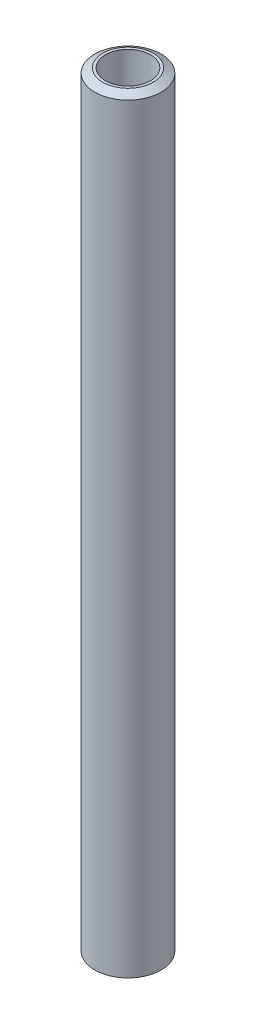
ISO-10303-21;
HEADER;
FILE_DESCRIPTION(('STEP AP214'),'2;1');
FILE_NAME('part.step','',(''),(''),'','','');
FILE_SCHEMA(('AUTOMOTIVE_DESIGN { 1 0 10303 214 1 1 1 1 }'));
ENDSEC;
DATA;
#1=APPLICATION_CONTEXT('core data for automotive mechanical design processes');
#2=APPLICATION_PROTOCOL_DEFINITION('international standard','automotive_design',2000,#1);
#3=PRODUCT_CONTEXT('',#1,'mechanical');
#4=PRODUCT('Part','Part','',(#3));
#5=PRODUCT_RELATED_PRODUCT_CATEGORY('part','',(#4));
#6=PRODUCT_DEFINITION_FORMATION('','',#4);
#7=PRODUCT_DEFINITION_CONTEXT('part definition',#1,'design');
#8=PRODUCT_DEFINITION('design','',#6,#7);
#9=PRODUCT_DEFINITION_SHAPE('','',#8);
#10=(LENGTH_UNIT() NAMED_UNIT(*) SI_UNIT(.MILLI.,.METRE.));
#11=(NAMED_UNIT(*) PLANE_ANGLE_UNIT() SI_UNIT($,.RADIAN.));
#12=(NAMED_UNIT(*) SI_UNIT($,.STERADIAN.) SOLID_ANGLE_UNIT());
#13=UNCERTAINTY_MEASURE_WITH_UNIT(LENGTH_MEASURE(1.E-05),#10,'distance_accuracy_value','');
#14=(GEOMETRIC_REPRESENTATION_CONTEXT(3) GLOBAL_UNCERTAINTY_ASSIGNED_CONTEXT((#13)) GLOBAL_UNIT_ASSIGNED_CONTEXT((#10,
#11,#12)) REPRESENTATION_CONTEXT('',''));
#15=CARTESIAN_POINT('',(0.,0.,0.));
#16=DIRECTION('',(0.,0.,1.));
#17=DIRECTION('',(1.,0.,0.));
#18=AXIS2_PLACEMENT_3D('',#15,#16,#17);
#19=CARTESIAN_POINT('',(0.,290.,0.));
#20=DIRECTION('',(0.,-1.,0.));
#21=DIRECTION('',(0.,0.,-1.));
#22=AXIS2_PLACEMENT_3D('',#19,#20,#21);
#23=CYLINDRICAL_SURFACE('',#22,12.5);
#24=CARTESIAN_POINT('',(0.,288.25,0.));
#25=DIRECTION('',(0.,1.,0.));
#26=DIRECTION('',(0.,0.,1.));
#27=AXIS2_PLACEMENT_3D('',#24,#25,#26);
#28=CIRCLE('',#27,12.5);
#29=CARTESIAN_POINT('',(0.,288.25,12.5));
#30=VERTEX_POINT('',#29);
#31=EDGE_CURVE('E10',#30,#30,#28,.F.);
#32=ORIENTED_EDGE('',*,*,#31,.T.);
#33=EDGE_LOOP('',(#32));
#34=FACE_BOUND('',#33,.T.);
#35=CARTESIAN_POINT('',(0.,1.74999999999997,0.));
#36=DIRECTION('',(0.,1.,0.));
#37=DIRECTION('',(0.,0.,1.));
#38=AXIS2_PLACEMENT_3D('',#35,#36,#37);
#39=CIRCLE('',#38,12.5);
#40=CARTESIAN_POINT('',(0.,1.74999999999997,12.5));
#41=VERTEX_POINT('',#40);
#42=EDGE_CURVE('E46',#41,#41,#39,.T.);
#43=ORIENTED_EDGE('',*,*,#42,.T.);
#44=EDGE_LOOP('',(#43));
#45=FACE_BOUND('',#44,.T.);
#46=ADVANCED_FACE('F31',(#34,#45),#23,.T.);
#47=CARTESIAN_POINT('',(0.,290.,0.));
#48=DIRECTION('',(0.,1.,0.));
#49=DIRECTION('',(0.,0.,1.));
#50=AXIS2_PLACEMENT_3D('',#47,#48,#49);
#51=PLANE('',#50);
#52=CARTESIAN_POINT('',(0.,290.,0.));
#53=DIRECTION('',(0.,1.,0.));
#54=DIRECTION('',(0.,0.,1.));
#55=AXIS2_PLACEMENT_3D('',#52,#53,#54);
#56=CIRCLE('',#55,9.49999999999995);
#57=CARTESIAN_POINT('',(0.,290.,9.49999999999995));
#58=VERTEX_POINT('',#57);
#59=EDGE_CURVE('E38',#58,#58,#56,.T.);
#60=ORIENTED_EDGE('',*,*,#59,.T.);
#61=EDGE_LOOP('',(#60));
#62=FACE_BOUND('',#61,.T.);
#63=CARTESIAN_POINT('',(0.,290.,0.));
#64=DIRECTION('',(0.,1.,0.));
#65=DIRECTION('',(0.,0.,1.));
#66=AXIS2_PLACEMENT_3D('',#63,#64,#65);
#67=CIRCLE('',#66,8.5);
#68=CARTESIAN_POINT('',(0.,290.,8.5));
#69=VERTEX_POINT('',#68);
#70=EDGE_CURVE('E52',#69,#69,#67,.T.);
#71=ORIENTED_EDGE('',*,*,#70,.F.);
#72=EDGE_LOOP('',(#71));
#73=FACE_BOUND('',#72,.T.);
#74=ADVANCED_FACE('F67',(#62,#73),#51,.T.);
#75=CARTESIAN_POINT('',(0.,0.,0.));
#76=DIRECTION('',(0.,1.,0.));
#77=DIRECTION('',(0.,0.,1.));
#78=AXIS2_PLACEMENT_3D('',#75,#76,#77);
#79=PLANE('',#78);
#80=CARTESIAN_POINT('',(0.,0.,0.));
#81=DIRECTION('',(0.,1.,0.));
#82=DIRECTION('',(0.,0.,1.));
#83=AXIS2_PLACEMENT_3D('',#80,#81,#82);
#84=CIRCLE('',#83,9.50000000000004);
#85=CARTESIAN_POINT('',(0.,0.,9.50000000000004));
#86=VERTEX_POINT('',#85);
#87=EDGE_CURVE('E42',#86,#86,#84,.F.);
#88=ORIENTED_EDGE('',*,*,#87,.T.);
#89=EDGE_LOOP('',(#88));
#90=FACE_BOUND('',#89,.T.);
#91=CARTESIAN_POINT('',(0.,0.,0.));
#92=DIRECTION('',(0.,1.,0.));
#93=DIRECTION('',(0.,0.,1.));
#94=AXIS2_PLACEMENT_3D('',#91,#92,#93);
#95=CIRCLE('',#94,8.5);
#96=CARTESIAN_POINT('',(0.,0.,8.5));
#97=VERTEX_POINT('',#96);
#98=EDGE_CURVE('E51',#97,#97,#95,.T.);
#99=ORIENTED_EDGE('',*,*,#98,.T.);
#100=EDGE_LOOP('',(#99));
#101=FACE_BOUND('',#100,.T.);
#102=ADVANCED_FACE('F58',(#90,#101),#79,.F.);
#103=CARTESIAN_POINT('',(0.,0.,0.));
#104=DIRECTION('',(0.,1.,0.));
#105=DIRECTION('',(0.,0.,1.));
#106=AXIS2_PLACEMENT_3D('',#103,#104,#105);
#107=CYLINDRICAL_SURFACE('',#106,8.5);
#108=ORIENTED_EDGE('',*,*,#98,.F.);
#109=EDGE_LOOP('',(#108));
#110=FACE_BOUND('',#109,.T.);
#111=ORIENTED_EDGE('',*,*,#70,.T.);
#112=EDGE_LOOP('',(#111));
#113=FACE_BOUND('',#112,.T.);
#114=ADVANCED_FACE('F60',(#110,#113),#107,.F.);
#115=CARTESIAN_POINT('',(0.,1.74999999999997,0.));
#116=DIRECTION('',(0.,1.,0.));
#117=DIRECTION('',(0.,0.,1.));
#118=AXIS2_PLACEMENT_3D('',#115,#116,#117);
#119=CONICAL_SURFACE('',#118,12.5,1.04272187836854);
#120=ORIENTED_EDGE('',*,*,#87,.F.);
#121=EDGE_LOOP('',(#120));
#122=FACE_BOUND('',#121,.T.);
#123=ORIENTED_EDGE('',*,*,#42,.F.);
#124=EDGE_LOOP('',(#123));
#125=FACE_BOUND('',#124,.T.);
#126=ADVANCED_FACE('F63',(#122,#125),#119,.T.);
#127=CARTESIAN_POINT('',(0.,290.,0.));
#128=DIRECTION('',(0.,-1.,0.));
#129=DIRECTION('',(0.,0.,-1.));
#130=AXIS2_PLACEMENT_3D('',#127,#128,#129);
#131=CONICAL_SURFACE('',#130,9.49999999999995,1.04272187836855);
#132=ORIENTED_EDGE('',*,*,#31,.F.);
#133=EDGE_LOOP('',(#132));
#134=FACE_BOUND('',#133,.T.);
#135=ORIENTED_EDGE('',*,*,#59,.F.);
#136=EDGE_LOOP('',(#135));
#137=FACE_BOUND('',#136,.T.);
#138=ADVANCED_FACE('F33',(#134,#137),#131,.T.);
#139=CLOSED_SHELL('',(#46,#74,#102,#114,#126,#138));
#140=MANIFOLD_SOLID_BREP('B2',#139);
#141=ADVANCED_BREP_SHAPE_REPRESENTATION('',(#18,#140),#14);
#142=SHAPE_DEFINITION_REPRESENTATION(#9,#141);
ENDSEC;
END-ISO-10303-21;
